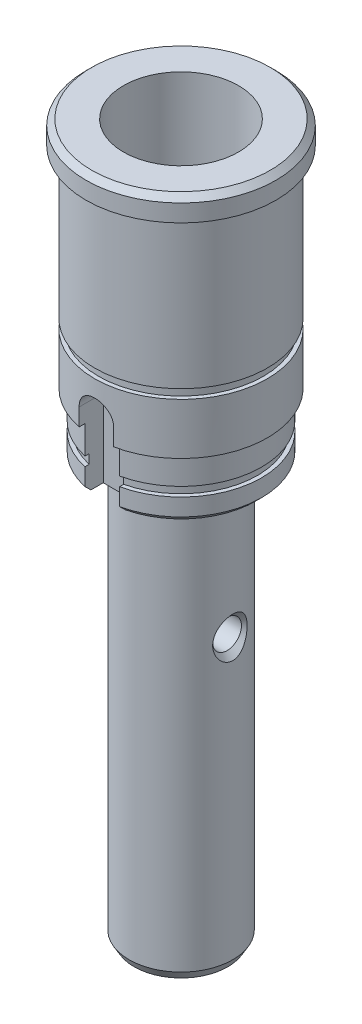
from build123d import *

# Parameters (mm, degrees)
CONG_1_R                = 0.5
CHANFREIN2_SIZE         = 1.5
CHANFREIN2_SIZE2        = 0.866025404
CHANFREIN3_SIZE         = 1
ENL_V_MAT_EXTRU_1_DEPTH = 128.48921523


with BuildPart() as part:
    # Esquisse1 → Base-R_volution (revolve)
    with BuildSketch(Plane.XY, mode=Mode.PRIVATE) as base_r_volution_sk:
        Polygon((0, 0), (16.5, 0), (16.5, -4), (15, -4), (15, -30), (14.3, -30), (14.3, -31.6), (15, -31.6), (15, -40.5), (14, -40.5), (14, -45.4), (13.3, -45.4), (13.3, -47), (14, -47), (14, -51), (9, -51), (9, -123.5), (0, -123.5), align=None)
    revolve(base_r_volution_sk.sketch.rotate(Axis((0, 9.985994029, 0), (0, -1, 0)), 90), axis=Axis((0, 9.985994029, 0), (0, -1, 0)))

    # Cong_1
    cong_1_edges = [part.edges().sort_by_distance(p)[0] for p in [
        (0, -4, -15),
    ]]
    fillet(cong_1_edges, radius=CONG_1_R)

    # Chanfrein2
    chanfrein2_edges = [part.edges().sort_by_distance(p)[0] for p in [
        (0, -123.5, -9),
    ]]
    chanfrein2_side = [part.faces().sort_by_distance(p)[0] for p in [
        (0, -87.25, -9),
    ]]
    chamfer(chanfrein2_edges, length=CHANFREIN2_SIZE, length2=CHANFREIN2_SIZE2, reference=chanfrein2_side[0])

    # Chanfrein3
    chanfrein3_edges = [part.edges().sort_by_distance(p)[0] for p in [
        (0, 0, -16.5),
        (0, -51, -14),
        (0, -51, -9),
    ]]
    chamfer(chanfrein3_edges, length=CHANFREIN3_SIZE)

    # Esquisse4 → Enl_v. mat.-Extru.1 (cut, through all)
    with BuildSketch(Plane.XY.offset(10.5)):
        with BuildLine():
            Line((-3, -52), (3, -52))
            Line((3, -52), (3, -37.5))
            ThreePointArc((3, -37.5), (0, -34.5), (-3, -37.5))
            Line((-3, -37.5), (-3, -52))
        make_face()
    extrude(amount=ENL_V_MAT_EXTRU_1_DEPTH, mode=Mode.SUBTRACT)

    # Esquisse6 → Enl_vement de mati_re-R_volution1 (revolve, cut)
    with BuildSketch(Plane.XY, mode=Mode.PRIVATE) as enl_vement_de_mati_re_r_volution1_sk:
        Polygon((-8, -71), (8, -71), (10, -69), (10, -73.5), (-10, -73.5), (-10, -69), align=None)
    revolve(enl_vement_de_mati_re_r_volution1_sk.sketch.rotate(Axis((13.806153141, -73.5, 0), (-1, 0, 0)), 90), axis=Axis((13.806153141, -73.5, 0), (-1, 0, 0)), mode=Mode.SUBTRACT)

    # Esquisse9 → Enl_vement de mati_re-R_volution2 (revolve, cut)
    with BuildSketch(Plane.XY, mode=Mode.PRIVATE) as enl_vement_de_mati_re_r_volution2_sk:
        Polygon((0, 0), (-10, 0), (-10, -46), (0, -51.773502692), align=None)
    revolve(enl_vement_de_mati_re_r_volution2_sk.sketch.rotate(Axis((0, 8.586517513, 0), (0, -1, 0)), 270), axis=Axis((0, 8.586517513, 0), (0, -1, 0)), mode=Mode.SUBTRACT)


solid = part.part
